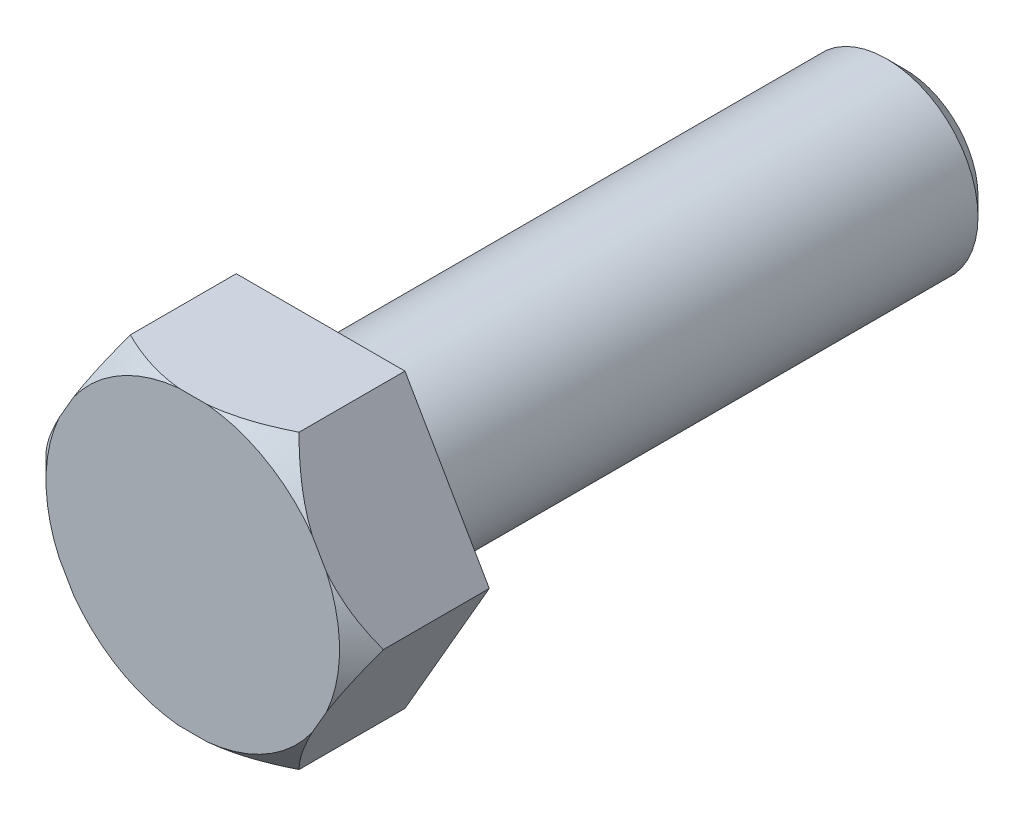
ISO-10303-21;
HEADER;
FILE_DESCRIPTION(('STEP AP214'),'2;1');
FILE_NAME('part.step','',(''),(''),'','','');
FILE_SCHEMA(('AUTOMOTIVE_DESIGN { 1 0 10303 214 1 1 1 1 }'));
ENDSEC;
DATA;
#1=APPLICATION_CONTEXT('core data for automotive mechanical design processes');
#2=APPLICATION_PROTOCOL_DEFINITION('international standard','automotive_design',2000,#1);
#3=PRODUCT_CONTEXT('',#1,'mechanical');
#4=PRODUCT('Part','Part','',(#3));
#5=PRODUCT_RELATED_PRODUCT_CATEGORY('part','',(#4));
#6=PRODUCT_DEFINITION_FORMATION('','',#4);
#7=PRODUCT_DEFINITION_CONTEXT('part definition',#1,'design');
#8=PRODUCT_DEFINITION('design','',#6,#7);
#9=PRODUCT_DEFINITION_SHAPE('','',#8);
#10=(LENGTH_UNIT() NAMED_UNIT(*) SI_UNIT(.MILLI.,.METRE.));
#11=(NAMED_UNIT(*) PLANE_ANGLE_UNIT() SI_UNIT($,.RADIAN.));
#12=(NAMED_UNIT(*) SI_UNIT($,.STERADIAN.) SOLID_ANGLE_UNIT());
#13=UNCERTAINTY_MEASURE_WITH_UNIT(LENGTH_MEASURE(1.E-05),#10,'distance_accuracy_value','');
#14=(GEOMETRIC_REPRESENTATION_CONTEXT(3) GLOBAL_UNCERTAINTY_ASSIGNED_CONTEXT((#13)) GLOBAL_UNIT_ASSIGNED_CONTEXT((#10,
#11,#12)) REPRESENTATION_CONTEXT('',''));
#15=CARTESIAN_POINT('',(0.,0.,0.));
#16=DIRECTION('',(0.,0.,1.));
#17=DIRECTION('',(1.,0.,0.));
#18=AXIS2_PLACEMENT_3D('',#15,#16,#17);
#19=CARTESIAN_POINT('',(0.,-2.5,0.));
#20=DIRECTION('',(0.,0.,1.));
#21=DIRECTION('',(1.,0.,0.));
#22=AXIS2_PLACEMENT_3D('',#19,#20,#21);
#23=PLANE('',#22);
#24=CARTESIAN_POINT('',(0.,0.,0.));
#25=DIRECTION('',(0.,0.,1.));
#26=DIRECTION('',(1.,0.,0.));
#27=AXIS2_PLACEMENT_3D('',#24,#25,#26);
#28=CIRCLE('',#27,2.5);
#29=CARTESIAN_POINT('',(2.5,0.,0.));
#30=VERTEX_POINT('',#29);
#31=EDGE_CURVE('E11',#30,#30,#28,.T.);
#32=ORIENTED_EDGE('',*,*,#31,.T.);
#33=EDGE_LOOP('',(#32));
#34=FACE_BOUND('',#33,.T.);
#35=ADVANCED_FACE('F39',(#34),#23,.T.);
#36=CARTESIAN_POINT('',(0.,0.,0.));
#37=DIRECTION('',(0.,0.,1.));
#38=DIRECTION('',(1.,0.,0.));
#39=AXIS2_PLACEMENT_3D('',#36,#37,#38);
#40=CYLINDRICAL_SURFACE('',#39,2.5);
#41=CARTESIAN_POINT('',(0.,0.,-15.5));
#42=DIRECTION('',(0.,0.,1.));
#43=DIRECTION('',(1.,0.,0.));
#44=AXIS2_PLACEMENT_3D('',#41,#42,#43);
#45=CIRCLE('',#44,2.5);
#46=CARTESIAN_POINT('',(2.5,0.,-15.5));
#47=VERTEX_POINT('',#46);
#48=EDGE_CURVE('E45',#47,#47,#45,.T.);
#49=ORIENTED_EDGE('',*,*,#48,.T.);
#50=EDGE_LOOP('',(#49));
#51=FACE_BOUND('',#50,.T.);
#52=ORIENTED_EDGE('',*,*,#31,.F.);
#53=EDGE_LOOP('',(#52));
#54=FACE_BOUND('',#53,.T.);
#55=ADVANCED_FACE('F65',(#51,#54),#40,.T.);
#56=CARTESIAN_POINT('',(0.,0.,-15.5));
#57=DIRECTION('',(0.,0.,1.));
#58=DIRECTION('',(1.,0.,0.));
#59=AXIS2_PLACEMENT_3D('',#56,#57,#58);
#60=CONICAL_SURFACE('',#59,2.5,0.785398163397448);
#61=CARTESIAN_POINT('',(0.,0.,-16.));
#62=DIRECTION('',(0.,0.,1.));
#63=DIRECTION('',(1.,0.,0.));
#64=AXIS2_PLACEMENT_3D('',#61,#62,#63);
#65=CIRCLE('',#64,2.);
#66=CARTESIAN_POINT('',(2.,0.,-16.));
#67=VERTEX_POINT('',#66);
#68=EDGE_CURVE('E49',#67,#67,#65,.T.);
#69=ORIENTED_EDGE('',*,*,#68,.T.);
#70=EDGE_LOOP('',(#69));
#71=FACE_BOUND('',#70,.T.);
#72=ORIENTED_EDGE('',*,*,#48,.F.);
#73=EDGE_LOOP('',(#72));
#74=FACE_BOUND('',#73,.T.);
#75=ADVANCED_FACE('F56',(#71,#74),#60,.T.);
#76=CARTESIAN_POINT('',(0.,-2.,-16.));
#77=DIRECTION('',(0.,0.,-1.));
#78=DIRECTION('',(-1.,0.,0.));
#79=AXIS2_PLACEMENT_3D('',#76,#77,#78);
#80=PLANE('',#79);
#81=ORIENTED_EDGE('',*,*,#68,.F.);
#82=EDGE_LOOP('',(#81));
#83=FACE_BOUND('',#82,.T.);
#84=ADVANCED_FACE('F59',(#83),#80,.T.);
#85=CLOSED_SHELL('',(#35,#55,#75,#84));
#86=MANIFOLD_SOLID_BREP('B2',#85);
#87=CARTESIAN_POINT('',(2.3094010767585,-4.,3.5));
#88=DIRECTION('',(-0.866025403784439,0.5,0.));
#89=DIRECTION('',(-0.5,-0.866025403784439,0.));
#90=AXIS2_PLACEMENT_3D('',#87,#88,#89);
#91=PLANE('',#90);
#92=DIRECTION('',(0.,0.,-1.));
#93=VECTOR('',#92,1.);
#94=CARTESIAN_POINT('',(4.61880215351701,0.,3.5));
#95=LINE('',#94,#93);
#96=CARTESIAN_POINT('',(4.61880215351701,0.,2.9));
#97=VERTEX_POINT('',#96);
#98=CARTESIAN_POINT('',(4.61880215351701,0.,0.));
#99=VERTEX_POINT('',#98);
#100=EDGE_CURVE('E242',#97,#99,#95,.T.);
#101=ORIENTED_EDGE('',*,*,#100,.F.);
#102=CARTESIAN_POINT('',(6.23236114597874,2.79476615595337,0.688498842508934));
#103=CARTESIAN_POINT('',(6.17765325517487,2.70000930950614,0.777178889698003));
#104=CARTESIAN_POINT('',(6.12272857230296,2.60487696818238,0.865328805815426));
#105=CARTESIAN_POINT('',(6.01237057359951,2.41373130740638,1.04036549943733));
#106=CARTESIAN_POINT('',(5.95693721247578,2.31771790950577,1.12725216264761));
#107=CARTESIAN_POINT('',(5.84536515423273,2.12446943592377,1.29974670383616));
#108=CARTESIAN_POINT('',(5.78922510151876,2.02723201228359,1.3853510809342));
#109=CARTESIAN_POINT('',(5.67628342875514,1.83161129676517,1.55479243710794));
#110=CARTESIAN_POINT('',(5.61948182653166,1.73322803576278,1.63862946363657));
#111=CARTESIAN_POINT('',(5.50353794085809,1.53240733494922,1.80647993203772));
#112=CARTESIAN_POINT('',(5.44437430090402,1.42993290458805,1.89043450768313));
#113=CARTESIAN_POINT('',(5.32511378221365,1.22336762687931,2.05564703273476));
#114=CARTESIAN_POINT('',(5.26501693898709,1.11927684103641,2.13690508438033));
#115=CARTESIAN_POINT('',(5.14378925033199,0.909304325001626,2.296059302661));
#116=CARTESIAN_POINT('',(5.08265932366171,0.803424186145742,2.37395825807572));
#117=CARTESIAN_POINT('',(4.95915384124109,0.589506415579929,2.52568435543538));
#118=CARTESIAN_POINT('',(4.89677844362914,0.481469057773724,2.59951200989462));
#119=CARTESIAN_POINT('',(4.76893339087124,0.260034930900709,2.74398038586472));
#120=CARTESIAN_POINT('',(4.7034254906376,0.146571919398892,2.81448663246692));
#121=CARTESIAN_POINT('',(4.570685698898,-0.0833401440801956,2.94879092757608));
#122=CARTESIAN_POINT('',(4.50345356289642,-0.199789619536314,3.01258801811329));
#123=CARTESIAN_POINT('',(4.3674844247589,-0.43529507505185,3.13137401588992));
#124=CARTESIAN_POINT('',(4.29875750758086,-0.554333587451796,3.1864086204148));
#125=CARTESIAN_POINT('',(4.15941510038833,-0.795681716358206,3.28596217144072));
#126=CARTESIAN_POINT('',(4.0888001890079,-0.91799033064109,3.3304842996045));
#127=CARTESIAN_POINT('',(3.95986044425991,-1.14132051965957,3.39923411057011));
#128=CARTESIAN_POINT('',(3.90183954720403,-1.24181566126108,3.42572915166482));
#129=CARTESIAN_POINT('',(3.78491444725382,-1.44433587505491,3.46929589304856));
#130=CARTESIAN_POINT('',(3.72601037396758,-1.54636072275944,3.48636896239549));
#131=CARTESIAN_POINT('',(3.60778145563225,-1.75113921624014,3.5102149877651));
#132=CARTESIAN_POINT('',(3.54845754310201,-1.85389124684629,3.51700617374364));
#133=CARTESIAN_POINT('',(3.42974154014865,-2.059513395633,3.51997326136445));
#134=CARTESIAN_POINT('',(3.3703494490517,-2.16238351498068,3.51614905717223));
#135=CARTESIAN_POINT('',(3.2521230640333,-2.36715762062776,3.49812146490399));
#136=CARTESIAN_POINT('',(3.19328771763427,-2.46906342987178,3.48394524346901));
#137=CARTESIAN_POINT('',(3.07639557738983,-2.67152655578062,3.44597172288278));
#138=CARTESIAN_POINT('',(3.01833897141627,-2.77208354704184,3.42217214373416));
#139=CARTESIAN_POINT('',(2.90311219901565,-2.97166217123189,3.36593528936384));
#140=CARTESIAN_POINT('',(2.84594516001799,-3.0706783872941,3.33347269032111));
#141=CARTESIAN_POINT('',(2.73281133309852,-3.26663192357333,3.26114482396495));
#142=CARTESIAN_POINT('',(2.67684448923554,-3.36356934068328,3.22127990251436));
#143=CARTESIAN_POINT('',(2.54652000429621,-3.58929797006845,3.12008468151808));
#144=CARTESIAN_POINT('',(2.47266940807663,-3.71721095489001,3.05615257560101));
#145=CARTESIAN_POINT('',(2.32705313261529,-3.969425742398,2.91934821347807));
#146=CARTESIAN_POINT('',(2.25528857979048,-4.09372559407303,2.84647123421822));
#147=CARTESIAN_POINT('',(2.11349363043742,-4.33932165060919,2.69363109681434));
#148=CARTESIAN_POINT('',(2.04346714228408,-4.46061108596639,2.61365354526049));
#149=CARTESIAN_POINT('',(1.90505877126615,-4.7003414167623,2.4482849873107));
#150=CARTESIAN_POINT('',(1.83667660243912,-4.81878280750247,2.36289493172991));
#151=CARTESIAN_POINT('',(1.70098891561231,-5.05380077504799,2.18743214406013));
#152=CARTESIAN_POINT('',(1.63368983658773,-5.17036619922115,2.09733958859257));
#153=CARTESIAN_POINT('',(1.50027452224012,-5.401448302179,1.91370612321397));
#154=CARTESIAN_POINT('',(1.43415838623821,-5.51596480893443,1.82016492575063));
#155=CARTESIAN_POINT('',(1.30300471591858,-5.74312962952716,1.63040915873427));
#156=CARTESIAN_POINT('',(1.23796608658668,-5.85577983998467,1.53419760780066));
#157=CARTESIAN_POINT('',(1.10874167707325,-6.07960308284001,1.33950918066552));
#158=CARTESIAN_POINT('',(1.0445559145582,-6.19077608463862,1.24103225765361));
#159=CARTESIAN_POINT('',(0.932766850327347,-6.38440042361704,1.06690301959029));
#160=CARTESIAN_POINT('',(0.885004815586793,-6.46712669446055,0.991657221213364));
#161=CARTESIAN_POINT('',(0.790056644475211,-6.63158175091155,0.840569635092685));
#162=CARTESIAN_POINT('',(0.742868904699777,-6.71331331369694,0.764731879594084));
#163=CARTESIAN_POINT('',(0.695842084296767,-6.79476615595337,0.688498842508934));
#164=B_SPLINE_CURVE_WITH_KNOTS('',3,(#102,#103,#104,#105,#106,#107,#108,#109,#110,#111,#112,
#113,#114,#115,#116,#117,#118,#119,#120,#121,#122,#123,#124,#125,#126,#127,#128,#129,#130,#131,
#132,#133,#134,#135,#136,#137,#138,#139,#140,#141,#142,#143,#144,#145,#146,#147,#148,#149,#150,
#151,#152,#153,#154,#155,#156,#157,#158,#159,#160,#161,#162,#163),.UNSPECIFIED.,.F.,.F.,(4,2,2,
2,2,2,2,2,2,2,2,2,2,2,2,2,2,2,2,2,2,2,2,2,2,2,2,2,2,2,4),(0.,0.422523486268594,
0.845084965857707,1.26864344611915,1.69219053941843,2.12741530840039,2.56262355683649,
2.99746324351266,3.43224806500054,3.87844266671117,4.32470089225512,4.76854968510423,
5.21226397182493,5.56900884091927,5.92570185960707,6.28176171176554,6.63782511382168,
6.99295744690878,7.34817396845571,7.70444045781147,8.06069030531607,8.54311709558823,
9.02579972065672,9.50948415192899,9.99308384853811,10.4789192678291,10.964795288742,
11.450142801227,11.9355003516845,12.3002974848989,12.6635031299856),.UNSPECIFIED.);
#165=CARTESIAN_POINT('',(3.65824766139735,-1.66372918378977,3.5));
#166=VERTEX_POINT('',#165);
#167=EDGE_CURVE('E220',#97,#166,#164,.T.);
#168=ORIENTED_EDGE('',*,*,#167,.T.);
#169=DIRECTION('',(0.5,0.866025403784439,0.));
#170=VECTOR('',#169,1.);
#171=CARTESIAN_POINT('',(2.3094010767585,-4.,3.5));
#172=LINE('',#171,#170);
#173=CARTESIAN_POINT('',(3.26995556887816,-2.33627081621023,3.5));
#174=VERTEX_POINT('',#173);
#175=EDGE_CURVE('E234',#174,#166,#172,.T.);
#176=ORIENTED_EDGE('',*,*,#175,.F.);
#177=CARTESIAN_POINT('',(2.3094010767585,-4.,2.9));
#178=VERTEX_POINT('',#177);
#179=EDGE_CURVE('E307',#174,#178,#164,.T.);
#180=ORIENTED_EDGE('',*,*,#179,.T.);
#181=DIRECTION('',(0.,0.,-1.));
#182=VECTOR('',#181,1.);
#183=CARTESIAN_POINT('',(2.3094010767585,-4.,3.5));
#184=LINE('',#183,#182);
#185=CARTESIAN_POINT('',(2.3094010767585,-4.,0.));
#186=VERTEX_POINT('',#185);
#187=EDGE_CURVE('E215',#178,#186,#184,.T.);
#188=ORIENTED_EDGE('',*,*,#187,.T.);
#189=DIRECTION('',(0.5,0.866025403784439,0.));
#190=VECTOR('',#189,1.);
#191=CARTESIAN_POINT('',(2.3094010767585,-4.,0.));
#192=LINE('',#191,#190);
#193=EDGE_CURVE('E216',#186,#99,#192,.T.);
#194=ORIENTED_EDGE('',*,*,#193,.T.);
#195=EDGE_LOOP('',(#101,#168,#176,#180,#188,#194));
#196=FACE_BOUND('',#195,.T.);
#197=ADVANCED_FACE('F95',(#196),#91,.F.);
#198=CARTESIAN_POINT('',(4.61880215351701,0.,3.5));
#199=DIRECTION('',(-0.866025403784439,-0.5,0.));
#200=DIRECTION('',(0.5,-0.866025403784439,0.));
#201=AXIS2_PLACEMENT_3D('',#198,#199,#200);
#202=PLANE('',#201);
#203=DIRECTION('',(0.,0.,-1.));
#204=VECTOR('',#203,1.);
#205=CARTESIAN_POINT('',(2.3094010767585,4.,3.5));
#206=LINE('',#205,#204);
#207=CARTESIAN_POINT('',(2.3094010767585,4.,2.9));
#208=VERTEX_POINT('',#207);
#209=CARTESIAN_POINT('',(2.3094010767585,4.,0.));
#210=VERTEX_POINT('',#209);
#211=EDGE_CURVE('E241',#208,#210,#206,.T.);
#212=ORIENTED_EDGE('',*,*,#211,.F.);
#213=CARTESIAN_POINT('',(0.695842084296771,6.79476615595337,0.688498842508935));
#214=CARTESIAN_POINT('',(0.75054997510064,6.70000930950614,0.777178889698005));
#215=CARTESIAN_POINT('',(0.805474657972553,6.60487696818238,0.865328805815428));
#216=CARTESIAN_POINT('',(0.915832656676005,6.41373130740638,1.04036549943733));
#217=CARTESIAN_POINT('',(0.971266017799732,6.31771790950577,1.12725216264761));
#218=CARTESIAN_POINT('',(1.08283807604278,6.12446943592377,1.29974670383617));
#219=CARTESIAN_POINT('',(1.13897812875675,6.02723201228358,1.3853510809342));
#220=CARTESIAN_POINT('',(1.25191980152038,5.83161129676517,1.55479243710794));
#221=CARTESIAN_POINT('',(1.30872140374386,5.73322803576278,1.63862946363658));
#222=CARTESIAN_POINT('',(1.42466528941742,5.53240733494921,1.80647993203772));
#223=CARTESIAN_POINT('',(1.48382892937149,5.42993290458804,1.89043450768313));
#224=CARTESIAN_POINT('',(1.60308944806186,5.22336762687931,2.05564703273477));
#225=CARTESIAN_POINT('',(1.66318629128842,5.11927684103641,2.13690508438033));
#226=CARTESIAN_POINT('',(1.78441397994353,4.90930432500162,2.296059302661));
#227=CARTESIAN_POINT('',(1.84554390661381,4.80342418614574,2.37395825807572));
#228=CARTESIAN_POINT('',(1.96904938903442,4.58950641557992,2.52568435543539));
#229=CARTESIAN_POINT('',(2.03142478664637,4.48146905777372,2.59951200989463));
#230=CARTESIAN_POINT('',(2.15926983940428,4.2600349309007,2.74398038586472));
#231=CARTESIAN_POINT('',(2.22477773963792,4.14657191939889,2.81448663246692));
#232=CARTESIAN_POINT('',(2.35751753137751,3.9166598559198,2.94879092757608));
#233=CARTESIAN_POINT('',(2.42474966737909,3.80021038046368,3.01258801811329));
#234=CARTESIAN_POINT('',(2.56071880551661,3.56470492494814,3.13137401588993));
#235=CARTESIAN_POINT('',(2.62944572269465,3.4456664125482,3.1864086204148));
#236=CARTESIAN_POINT('',(2.76878812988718,3.20431828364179,3.28596217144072));
#237=CARTESIAN_POINT('',(2.83940304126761,3.0820096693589,3.3304842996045));
#238=CARTESIAN_POINT('',(2.9683427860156,2.85867948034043,3.39923411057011));
#239=CARTESIAN_POINT('',(3.02636368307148,2.75818433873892,3.42572915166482));
#240=CARTESIAN_POINT('',(3.14328878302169,2.55566412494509,3.46929589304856));
#241=CARTESIAN_POINT('',(3.20219285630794,2.45363927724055,3.48636896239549));
#242=CARTESIAN_POINT('',(3.32042177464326,2.24886078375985,3.5102149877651));
#243=CARTESIAN_POINT('',(3.3797456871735,2.1461087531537,3.51700617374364));
#244=CARTESIAN_POINT('',(3.49846169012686,1.94048660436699,3.51997326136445));
#245=CARTESIAN_POINT('',(3.55785378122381,1.83761648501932,3.51614905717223));
#246=CARTESIAN_POINT('',(3.67608016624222,1.63284237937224,3.49812146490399));
#247=CARTESIAN_POINT('',(3.73491551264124,1.53093657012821,3.48394524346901));
#248=CARTESIAN_POINT('',(3.85180765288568,1.32847344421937,3.44597172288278));
#249=CARTESIAN_POINT('',(3.90986425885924,1.22791645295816,3.42217214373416));
#250=CARTESIAN_POINT('',(4.02509103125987,1.02833782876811,3.36593528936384));
#251=CARTESIAN_POINT('',(4.08225807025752,0.929321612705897,3.33347269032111));
#252=CARTESIAN_POINT('',(4.19539189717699,0.733368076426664,3.26114482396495));
#253=CARTESIAN_POINT('',(4.25135874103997,0.636430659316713,3.22127990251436));
#254=CARTESIAN_POINT('',(4.3816832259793,0.410702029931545,3.12008468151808));
#255=CARTESIAN_POINT('',(4.45553382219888,0.282789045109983,3.05615257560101));
#256=CARTESIAN_POINT('',(4.60115009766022,0.0305742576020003,2.91934821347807));
#257=CARTESIAN_POINT('',(4.67291465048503,-0.0937255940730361,2.84647123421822));
#258=CARTESIAN_POINT('',(4.81470959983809,-0.33932165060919,2.69363109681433));
#259=CARTESIAN_POINT('',(4.88473608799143,-0.460611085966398,2.61365354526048));
#260=CARTESIAN_POINT('',(5.02314445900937,-0.700341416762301,2.4482849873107));
#261=CARTESIAN_POINT('',(5.0915266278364,-0.818782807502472,2.36289493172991));
#262=CARTESIAN_POINT('',(5.2272143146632,-1.05380077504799,2.18743214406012));
#263=CARTESIAN_POINT('',(5.29451339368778,-1.17036619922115,2.09733958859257));
#264=CARTESIAN_POINT('',(5.4279287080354,-1.401448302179,1.91370612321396));
#265=CARTESIAN_POINT('',(5.4940448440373,-1.51596480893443,1.82016492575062));
#266=CARTESIAN_POINT('',(5.62519851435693,-1.74312962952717,1.63040915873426));
#267=CARTESIAN_POINT('',(5.69023714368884,-1.85577983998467,1.53419760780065));
#268=CARTESIAN_POINT('',(5.81946155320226,-2.07960308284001,1.33950918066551));
#269=CARTESIAN_POINT('',(5.88364731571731,-2.19077608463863,1.24103225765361));
#270=CARTESIAN_POINT('',(5.99543637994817,-2.38440042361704,1.06690301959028));
#271=CARTESIAN_POINT('',(6.04319841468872,-2.46712669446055,0.991657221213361));
#272=CARTESIAN_POINT('',(6.1381465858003,-2.63158175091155,0.840569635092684));
#273=CARTESIAN_POINT('',(6.18533432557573,-2.71331331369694,0.764731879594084));
#274=CARTESIAN_POINT('',(6.23236114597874,-2.79476615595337,0.688498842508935));
#275=B_SPLINE_CURVE_WITH_KNOTS('',3,(#213,#214,#215,#216,#217,#218,#219,#220,#221,#222,#223,
#224,#225,#226,#227,#228,#229,#230,#231,#232,#233,#234,#235,#236,#237,#238,#239,#240,#241,#242,
#243,#244,#245,#246,#247,#248,#249,#250,#251,#252,#253,#254,#255,#256,#257,#258,#259,#260,#261,
#262,#263,#264,#265,#266,#267,#268,#269,#270,#271,#272,#273,#274),.UNSPECIFIED.,.F.,.F.,(4,2,2,
2,2,2,2,2,2,2,2,2,2,2,2,2,2,2,2,2,2,2,2,2,2,2,2,2,2,2,4),(0.,0.422523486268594,
0.845084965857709,1.26864344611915,1.69219053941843,2.12741530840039,2.5626235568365,
2.99746324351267,3.43224806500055,3.87844266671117,4.32470089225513,4.76854968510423,
5.21226397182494,5.56900884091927,5.92570185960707,6.28176171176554,6.63782511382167,
6.99295744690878,7.34817396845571,7.70444045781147,8.06069030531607,8.54311709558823,
9.02579972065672,9.50948415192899,9.99308384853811,10.4789192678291,10.9647952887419,
11.450142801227,11.9355003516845,12.3002974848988,12.6635031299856),.UNSPECIFIED.);
#276=CARTESIAN_POINT('',(3.26995556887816,2.33627081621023,3.5));
#277=VERTEX_POINT('',#276);
#278=EDGE_CURVE('E270',#208,#277,#275,.T.);
#279=ORIENTED_EDGE('',*,*,#278,.T.);
#280=DIRECTION('',(-0.5,0.866025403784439,0.));
#281=VECTOR('',#280,1.);
#282=CARTESIAN_POINT('',(4.61880215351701,0.,3.5));
#283=LINE('',#282,#281);
#284=CARTESIAN_POINT('',(3.65824766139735,1.66372918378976,3.5));
#285=VERTEX_POINT('',#284);
#286=EDGE_CURVE('E209',#285,#277,#283,.T.);
#287=ORIENTED_EDGE('',*,*,#286,.F.);
#288=EDGE_CURVE('E275',#285,#97,#275,.T.);
#289=ORIENTED_EDGE('',*,*,#288,.T.);
#290=ORIENTED_EDGE('',*,*,#100,.T.);
#291=DIRECTION('',(-0.5,0.866025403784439,0.));
#292=VECTOR('',#291,1.);
#293=CARTESIAN_POINT('',(4.61880215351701,0.,0.));
#294=LINE('',#293,#292);
#295=EDGE_CURVE('E219',#99,#210,#294,.T.);
#296=ORIENTED_EDGE('',*,*,#295,.T.);
#297=EDGE_LOOP('',(#212,#279,#287,#289,#290,#296));
#298=FACE_BOUND('',#297,.T.);
#299=ADVANCED_FACE('F280',(#298),#202,.F.);
#300=CARTESIAN_POINT('',(2.3094010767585,4.,3.5));
#301=DIRECTION('',(0.,-1.,0.));
#302=DIRECTION('',(1.,0.,0.));
#303=AXIS2_PLACEMENT_3D('',#300,#301,#302);
#304=PLANE('',#303);
#305=DIRECTION('',(0.,0.,-1.));
#306=VECTOR('',#305,1.);
#307=CARTESIAN_POINT('',(-2.3094010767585,4.,3.5));
#308=LINE('',#307,#306);
#309=CARTESIAN_POINT('',(-2.3094010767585,4.,2.9));
#310=VERTEX_POINT('',#309);
#311=CARTESIAN_POINT('',(-2.3094010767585,4.,0.));
#312=VERTEX_POINT('',#311);
#313=EDGE_CURVE('E239',#310,#312,#308,.T.);
#314=ORIENTED_EDGE('',*,*,#313,.F.);
#315=CARTESIAN_POINT('',(-5.10416723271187,4.,1.03401047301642));
#316=CARTESIAN_POINT('',(-4.98985882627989,4.,1.12396648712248));
#317=CARTESIAN_POINT('',(-4.87500222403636,4.,1.21323480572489));
#318=CARTESIAN_POINT('',(-4.64398100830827,4.,1.39010065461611));
#319=CARTESIAN_POINT('',(-4.52781618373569,4.,1.47769790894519));
#320=CARTESIAN_POINT('',(-4.29341594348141,4.,1.6513323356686));
#321=CARTESIAN_POINT('',(-4.17517305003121,4.,1.7373594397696));
#322=CARTESIAN_POINT('',(-3.93695487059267,4.,1.90697407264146));
#323=CARTESIAN_POINT('',(-3.81697966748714,4.,1.99056171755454));
#324=CARTESIAN_POINT('',(-3.56903053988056,4.,2.15883212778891));
#325=CARTESIAN_POINT('',(-3.44095437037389,4.,2.24336480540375));
#326=CARTESIAN_POINT('',(-3.18221357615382,4.,2.40836670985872));
#327=CARTESIAN_POINT('',(-3.05154916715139,4.,2.48883627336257));
#328=CARTESIAN_POINT('',(-2.78744760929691,4.,2.6445324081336));
#329=CARTESIAN_POINT('',(-2.65401614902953,4.,2.71976857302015));
#330=CARTESIAN_POINT('',(-2.38373289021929,4.,2.86379345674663));
#331=CARTESIAN_POINT('',(-2.24688202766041,4.,2.93258391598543));
#332=CARTESIAN_POINT('',(-1.98367043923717,4.,3.05530153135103));
#333=CARTESIAN_POINT('',(-1.85768607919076,4.,3.11002999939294));
#334=CARTESIAN_POINT('',(-1.60243753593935,4.,3.21135635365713));
#335=CARTESIAN_POINT('',(-1.47317303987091,4.,3.25795346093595));
#336=CARTESIAN_POINT('',(-1.21292441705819,4.,3.34074586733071));
#337=CARTESIAN_POINT('',(-1.08197637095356,4.,3.37705304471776));
#338=CARTESIAN_POINT('',(-0.817433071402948,4.,3.43815768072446));
#339=CARTESIAN_POINT('',(-0.683838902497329,4.,3.46295975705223));
#340=CARTESIAN_POINT('',(-0.412316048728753,4.,3.49989685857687));
#341=CARTESIAN_POINT('',(-0.274353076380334,4.,3.51178529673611));
#342=CARTESIAN_POINT('',(0.00205892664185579,4.,3.52118634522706));
#343=CARTESIAN_POINT('',(0.1405079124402,4.,3.51870024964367));
#344=CARTESIAN_POINT('',(0.41681462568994,4.,3.49951454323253));
#345=CARTESIAN_POINT('',(0.554669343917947,4.,3.48277242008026));
#346=CARTESIAN_POINT('',(0.828137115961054,4.,3.43620184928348));
#347=CARTESIAN_POINT('',(0.963749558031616,4.,3.40636988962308));
#348=CARTESIAN_POINT('',(1.27307598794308,4.,3.32450160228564));
#349=CARTESIAN_POINT('',(1.44572159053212,4.,3.26846152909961));
#350=CARTESIAN_POINT('',(1.78533180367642,4.,3.14129797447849));
#351=CARTESIAN_POINT('',(1.95229295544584,4.,3.07016549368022));
#352=CARTESIAN_POINT('',(2.28202183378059,4.,2.91595160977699));
#353=CARTESIAN_POINT('',(2.44474983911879,4.,2.83278642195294));
#354=CARTESIAN_POINT('',(2.76538092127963,4.,2.65780460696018));
#355=CARTESIAN_POINT('',(2.92328510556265,4.,2.56598998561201));
#356=CARTESIAN_POINT('',(3.25793446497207,4.,2.36185945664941));
#357=CARTESIAN_POINT('',(3.43404610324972,4.,2.24851177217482));
#358=CARTESIAN_POINT('',(3.78201930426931,4.,2.01543949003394));
#359=CARTESIAN_POINT('',(3.95387990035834,4.,1.89571346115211));
#360=CARTESIAN_POINT('',(4.29033684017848,4.,1.65419733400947));
#361=CARTESIAN_POINT('',(4.45500968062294,4.,1.53251336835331));
#362=CARTESIAN_POINT('',(4.69993893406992,4.,1.34736923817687));
#363=CARTESIAN_POINT('',(4.78120758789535,4.,1.28524011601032));
#364=CARTESIAN_POINT('',(4.94313113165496,4.,1.16019346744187));
#365=CARTESIAN_POINT('',(5.02378604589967,4.,1.09727597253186));
#366=CARTESIAN_POINT('',(5.10416723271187,4.,1.03401047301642));
#367=B_SPLINE_CURVE_WITH_KNOTS('',3,(#315,#316,#317,#318,#319,#320,#321,#322,#323,#324,#325,
#326,#327,#328,#329,#330,#331,#332,#333,#334,#335,#336,#337,#338,#339,#340,#341,#342,#343,#344,
#345,#346,#347,#348,#349,#350,#351,#352,#353,#354,#355,#356,#357,#358,#359,#360,#361,#362,#363,
#364,#365,#366),.UNSPECIFIED.,.F.,.F.,(4,2,2,2,2,2,2,2,2,2,2,2,2,2,2,2,2,2,2,2,2,2,2,2,2,4),(0.,
0.436384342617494,0.872840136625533,1.31149215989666,1.75012326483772,2.2104351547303,
2.67070884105,3.13011523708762,3.58939722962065,4.00124375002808,4.4131297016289,
4.82034865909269,5.22740403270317,5.64210248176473,6.05676359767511,6.47266560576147,
6.88867926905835,7.43226364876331,7.97617307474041,8.52407040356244,9.07184098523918,
9.6999549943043,10.3282105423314,10.9424080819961,11.2492945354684,11.5561687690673),.UNSPECIFIED.);
#368=CARTESIAN_POINT('',(-0.388292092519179,4.,3.5));
#369=VERTEX_POINT('',#368);
#370=EDGE_CURVE('E257',#310,#369,#367,.T.);
#371=ORIENTED_EDGE('',*,*,#370,.T.);
#372=DIRECTION('',(-1.,0.,0.));
#373=VECTOR('',#372,1.);
#374=CARTESIAN_POINT('',(2.3094010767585,4.,3.5));
#375=LINE('',#374,#373);
#376=CARTESIAN_POINT('',(0.38829209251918,4.,3.5));
#377=VERTEX_POINT('',#376);
#378=EDGE_CURVE('E205',#377,#369,#375,.T.);
#379=ORIENTED_EDGE('',*,*,#378,.F.);
#380=EDGE_CURVE('E263',#377,#208,#367,.T.);
#381=ORIENTED_EDGE('',*,*,#380,.T.);
#382=ORIENTED_EDGE('',*,*,#211,.T.);
#383=DIRECTION('',(-1.,0.,0.));
#384=VECTOR('',#383,1.);
#385=CARTESIAN_POINT('',(2.3094010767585,4.,0.));
#386=LINE('',#385,#384);
#387=EDGE_CURVE('E223',#210,#312,#386,.T.);
#388=ORIENTED_EDGE('',*,*,#387,.T.);
#389=EDGE_LOOP('',(#314,#371,#379,#381,#382,#388));
#390=FACE_BOUND('',#389,.T.);
#391=ADVANCED_FACE('F261',(#390),#304,.F.);
#392=CARTESIAN_POINT('',(-2.3094010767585,4.,3.5));
#393=DIRECTION('',(0.866025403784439,-0.5,0.));
#394=DIRECTION('',(0.5,0.866025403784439,0.));
#395=AXIS2_PLACEMENT_3D('',#392,#393,#394);
#396=PLANE('',#395);
#397=DIRECTION('',(0.,0.,-1.));
#398=VECTOR('',#397,1.);
#399=CARTESIAN_POINT('',(-4.61880215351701,0.,3.5));
#400=LINE('',#399,#398);
#401=CARTESIAN_POINT('',(-4.61880215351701,0.,2.9));
#402=VERTEX_POINT('',#401);
#403=CARTESIAN_POINT('',(-4.61880215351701,0.,0.));
#404=VERTEX_POINT('',#403);
#405=EDGE_CURVE('E197',#402,#404,#400,.T.);
#406=ORIENTED_EDGE('',*,*,#405,.F.);
#407=CARTESIAN_POINT('',(-6.23236114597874,-2.79476615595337,0.688498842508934));
#408=CARTESIAN_POINT('',(-6.17765325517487,-2.70000930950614,0.777178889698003));
#409=CARTESIAN_POINT('',(-6.12272857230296,-2.60487696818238,0.865328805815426));
#410=CARTESIAN_POINT('',(-6.01237057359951,-2.41373130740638,1.04036549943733));
#411=CARTESIAN_POINT('',(-5.95693721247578,-2.31771790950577,1.12725216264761));
#412=CARTESIAN_POINT('',(-5.84536515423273,-2.12446943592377,1.29974670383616));
#413=CARTESIAN_POINT('',(-5.78922510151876,-2.02723201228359,1.3853510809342));
#414=CARTESIAN_POINT('',(-5.67628342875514,-1.83161129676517,1.55479243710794));
#415=CARTESIAN_POINT('',(-5.61948182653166,-1.73322803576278,1.63862946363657));
#416=CARTESIAN_POINT('',(-5.50353794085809,-1.53240733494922,1.80647993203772));
#417=CARTESIAN_POINT('',(-5.44437430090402,-1.42993290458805,1.89043450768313));
#418=CARTESIAN_POINT('',(-5.32511378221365,-1.22336762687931,2.05564703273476));
#419=CARTESIAN_POINT('',(-5.26501693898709,-1.11927684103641,2.13690508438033));
#420=CARTESIAN_POINT('',(-5.14378925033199,-0.909304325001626,2.296059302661));
#421=CARTESIAN_POINT('',(-5.08265932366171,-0.803424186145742,2.37395825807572));
#422=CARTESIAN_POINT('',(-4.95915384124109,-0.589506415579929,2.52568435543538));
#423=CARTESIAN_POINT('',(-4.89677844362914,-0.481469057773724,2.59951200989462));
#424=CARTESIAN_POINT('',(-4.76893339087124,-0.260034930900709,2.74398038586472));
#425=CARTESIAN_POINT('',(-4.7034254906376,-0.146571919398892,2.81448663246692));
#426=CARTESIAN_POINT('',(-4.570685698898,0.0833401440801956,2.94879092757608));
#427=CARTESIAN_POINT('',(-4.50345356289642,0.199789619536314,3.01258801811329));
#428=CARTESIAN_POINT('',(-4.3674844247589,0.43529507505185,3.13137401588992));
#429=CARTESIAN_POINT('',(-4.29875750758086,0.554333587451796,3.1864086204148));
#430=CARTESIAN_POINT('',(-4.15941510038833,0.795681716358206,3.28596217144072));
#431=CARTESIAN_POINT('',(-4.0888001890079,0.91799033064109,3.3304842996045));
#432=CARTESIAN_POINT('',(-3.95986044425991,1.14132051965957,3.39923411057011));
#433=CARTESIAN_POINT('',(-3.90183954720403,1.24181566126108,3.42572915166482));
#434=CARTESIAN_POINT('',(-3.78491444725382,1.44433587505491,3.46929589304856));
#435=CARTESIAN_POINT('',(-3.72601037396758,1.54636072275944,3.48636896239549));
#436=CARTESIAN_POINT('',(-3.60778145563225,1.75113921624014,3.5102149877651));
#437=CARTESIAN_POINT('',(-3.54845754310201,1.85389124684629,3.51700617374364));
#438=CARTESIAN_POINT('',(-3.42974154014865,2.059513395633,3.51997326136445));
#439=CARTESIAN_POINT('',(-3.3703494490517,2.16238351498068,3.51614905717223));
#440=CARTESIAN_POINT('',(-3.2521230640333,2.36715762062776,3.49812146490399));
#441=CARTESIAN_POINT('',(-3.19328771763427,2.46906342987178,3.48394524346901));
#442=CARTESIAN_POINT('',(-3.07639557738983,2.67152655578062,3.44597172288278));
#443=CARTESIAN_POINT('',(-3.01833897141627,2.77208354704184,3.42217214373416));
#444=CARTESIAN_POINT('',(-2.90311219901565,2.97166217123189,3.36593528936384));
#445=CARTESIAN_POINT('',(-2.84594516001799,3.0706783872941,3.33347269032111));
#446=CARTESIAN_POINT('',(-2.73281133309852,3.26663192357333,3.26114482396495));
#447=CARTESIAN_POINT('',(-2.67684448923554,3.36356934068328,3.22127990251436));
#448=CARTESIAN_POINT('',(-2.54652000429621,3.58929797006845,3.12008468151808));
#449=CARTESIAN_POINT('',(-2.47266940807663,3.71721095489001,3.05615257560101));
#450=CARTESIAN_POINT('',(-2.32705313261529,3.969425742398,2.91934821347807));
#451=CARTESIAN_POINT('',(-2.25528857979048,4.09372559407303,2.84647123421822));
#452=CARTESIAN_POINT('',(-2.11349363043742,4.33932165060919,2.69363109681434));
#453=CARTESIAN_POINT('',(-2.04346714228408,4.46061108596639,2.61365354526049));
#454=CARTESIAN_POINT('',(-1.90505877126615,4.7003414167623,2.4482849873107));
#455=CARTESIAN_POINT('',(-1.83667660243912,4.81878280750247,2.36289493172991));
#456=CARTESIAN_POINT('',(-1.70098891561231,5.05380077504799,2.18743214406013));
#457=CARTESIAN_POINT('',(-1.63368983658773,5.17036619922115,2.09733958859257));
#458=CARTESIAN_POINT('',(-1.50027452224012,5.401448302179,1.91370612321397));
#459=CARTESIAN_POINT('',(-1.43415838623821,5.51596480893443,1.82016492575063));
#460=CARTESIAN_POINT('',(-1.30300471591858,5.74312962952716,1.63040915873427));
#461=CARTESIAN_POINT('',(-1.23796608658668,5.85577983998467,1.53419760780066));
#462=CARTESIAN_POINT('',(-1.10874167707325,6.07960308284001,1.33950918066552));
#463=CARTESIAN_POINT('',(-1.0445559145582,6.19077608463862,1.24103225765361));
#464=CARTESIAN_POINT('',(-0.932766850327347,6.38440042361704,1.06690301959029));
#465=CARTESIAN_POINT('',(-0.885004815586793,6.46712669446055,0.991657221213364));
#466=CARTESIAN_POINT('',(-0.790056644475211,6.63158175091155,0.840569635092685));
#467=CARTESIAN_POINT('',(-0.742868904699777,6.71331331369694,0.764731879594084));
#468=CARTESIAN_POINT('',(-0.695842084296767,6.79476615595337,0.688498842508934));
#469=B_SPLINE_CURVE_WITH_KNOTS('',3,(#407,#408,#409,#410,#411,#412,#413,#414,#415,#416,#417,
#418,#419,#420,#421,#422,#423,#424,#425,#426,#427,#428,#429,#430,#431,#432,#433,#434,#435,#436,
#437,#438,#439,#440,#441,#442,#443,#444,#445,#446,#447,#448,#449,#450,#451,#452,#453,#454,#455,
#456,#457,#458,#459,#460,#461,#462,#463,#464,#465,#466,#467,#468),.UNSPECIFIED.,.F.,.F.,(4,2,2,
2,2,2,2,2,2,2,2,2,2,2,2,2,2,2,2,2,2,2,2,2,2,2,2,2,2,2,4),(0.,0.422523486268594,
0.845084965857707,1.26864344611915,1.69219053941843,2.12741530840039,2.56262355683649,
2.99746324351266,3.43224806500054,3.87844266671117,4.32470089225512,4.76854968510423,
5.21226397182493,5.56900884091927,5.92570185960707,6.28176171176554,6.63782511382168,
6.99295744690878,7.34817396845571,7.70444045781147,8.06069030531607,8.54311709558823,
9.02579972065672,9.50948415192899,9.99308384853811,10.4789192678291,10.964795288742,
11.450142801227,11.9355003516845,12.3002974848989,12.6635031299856),.UNSPECIFIED.);
#470=CARTESIAN_POINT('',(-3.65824766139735,1.66372918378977,3.5));
#471=VERTEX_POINT('',#470);
#472=EDGE_CURVE('E184',#402,#471,#469,.T.);
#473=ORIENTED_EDGE('',*,*,#472,.T.);
#474=DIRECTION('',(-0.5,-0.866025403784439,0.));
#475=VECTOR('',#474,1.);
#476=CARTESIAN_POINT('',(-2.3094010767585,4.,3.5));
#477=LINE('',#476,#475);
#478=CARTESIAN_POINT('',(-3.26995556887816,2.33627081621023,3.5));
#479=VERTEX_POINT('',#478);
#480=EDGE_CURVE('E195',#479,#471,#477,.T.);
#481=ORIENTED_EDGE('',*,*,#480,.F.);
#482=EDGE_CURVE('E198',#479,#310,#469,.T.);
#483=ORIENTED_EDGE('',*,*,#482,.T.);
#484=ORIENTED_EDGE('',*,*,#313,.T.);
#485=DIRECTION('',(-0.5,-0.866025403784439,0.));
#486=VECTOR('',#485,1.);
#487=CARTESIAN_POINT('',(-2.3094010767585,4.,0.));
#488=LINE('',#487,#486);
#489=EDGE_CURVE('E226',#312,#404,#488,.T.);
#490=ORIENTED_EDGE('',*,*,#489,.T.);
#491=EDGE_LOOP('',(#406,#473,#481,#483,#484,#490));
#492=FACE_BOUND('',#491,.T.);
#493=ADVANCED_FACE('F193',(#492),#396,.F.);
#494=CARTESIAN_POINT('',(-4.61880215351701,0.,3.5));
#495=DIRECTION('',(0.866025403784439,0.5,0.));
#496=DIRECTION('',(-0.5,0.866025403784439,0.));
#497=AXIS2_PLACEMENT_3D('',#494,#495,#496);
#498=PLANE('',#497);
#499=DIRECTION('',(0.,0.,-1.));
#500=VECTOR('',#499,1.);
#501=CARTESIAN_POINT('',(-2.3094010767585,-4.,3.5));
#502=LINE('',#501,#500);
#503=CARTESIAN_POINT('',(-2.3094010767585,-4.,2.9));
#504=VERTEX_POINT('',#503);
#505=CARTESIAN_POINT('',(-2.3094010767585,-4.,0.));
#506=VERTEX_POINT('',#505);
#507=EDGE_CURVE('E236',#504,#506,#502,.T.);
#508=ORIENTED_EDGE('',*,*,#507,.F.);
#509=CARTESIAN_POINT('',(-0.695842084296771,-6.79476615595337,0.688498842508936));
#510=CARTESIAN_POINT('',(-0.750549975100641,-6.70000930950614,0.777178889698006));
#511=CARTESIAN_POINT('',(-0.805474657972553,-6.60487696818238,0.865328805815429));
#512=CARTESIAN_POINT('',(-0.915832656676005,-6.41373130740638,1.04036549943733));
#513=CARTESIAN_POINT('',(-0.971266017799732,-6.31771790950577,1.12725216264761));
#514=CARTESIAN_POINT('',(-1.08283807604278,-6.12446943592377,1.29974670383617));
#515=CARTESIAN_POINT('',(-1.13897812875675,-6.02723201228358,1.3853510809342));
#516=CARTESIAN_POINT('',(-1.25191980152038,-5.83161129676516,1.55479243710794));
#517=CARTESIAN_POINT('',(-1.30872140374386,-5.73322803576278,1.63862946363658));
#518=CARTESIAN_POINT('',(-1.42466528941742,-5.53240733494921,1.80647993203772));
#519=CARTESIAN_POINT('',(-1.4838289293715,-5.42993290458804,1.89043450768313));
#520=CARTESIAN_POINT('',(-1.60308944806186,-5.22336762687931,2.05564703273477));
#521=CARTESIAN_POINT('',(-1.66318629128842,-5.11927684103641,2.13690508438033));
#522=CARTESIAN_POINT('',(-1.78441397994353,-4.90930432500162,2.296059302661));
#523=CARTESIAN_POINT('',(-1.84554390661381,-4.80342418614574,2.37395825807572));
#524=CARTESIAN_POINT('',(-1.96904938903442,-4.58950641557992,2.52568435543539));
#525=CARTESIAN_POINT('',(-2.03142478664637,-4.48146905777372,2.59951200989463));
#526=CARTESIAN_POINT('',(-2.15926983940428,-4.2600349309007,2.74398038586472));
#527=CARTESIAN_POINT('',(-2.22477773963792,-4.14657191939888,2.81448663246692));
#528=CARTESIAN_POINT('',(-2.35751753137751,-3.9166598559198,2.94879092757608));
#529=CARTESIAN_POINT('',(-2.42474966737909,-3.80021038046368,3.01258801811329));
#530=CARTESIAN_POINT('',(-2.56071880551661,-3.56470492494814,3.13137401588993));
#531=CARTESIAN_POINT('',(-2.62944572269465,-3.4456664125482,3.1864086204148));
#532=CARTESIAN_POINT('',(-2.76878812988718,-3.20431828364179,3.28596217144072));
#533=CARTESIAN_POINT('',(-2.83940304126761,-3.0820096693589,3.3304842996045));
#534=CARTESIAN_POINT('',(-2.9683427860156,-2.85867948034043,3.39923411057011));
#535=CARTESIAN_POINT('',(-3.02636368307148,-2.75818433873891,3.42572915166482));
#536=CARTESIAN_POINT('',(-3.14328878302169,-2.55566412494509,3.46929589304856));
#537=CARTESIAN_POINT('',(-3.20219285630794,-2.45363927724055,3.48636896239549));
#538=CARTESIAN_POINT('',(-3.32042177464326,-2.24886078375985,3.5102149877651));
#539=CARTESIAN_POINT('',(-3.3797456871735,-2.1461087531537,3.51700617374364));
#540=CARTESIAN_POINT('',(-3.49846169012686,-1.94048660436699,3.51997326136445));
#541=CARTESIAN_POINT('',(-3.55785378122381,-1.83761648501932,3.51614905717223));
#542=CARTESIAN_POINT('',(-3.67608016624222,-1.63284237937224,3.49812146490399));
#543=CARTESIAN_POINT('',(-3.73491551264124,-1.53093657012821,3.483945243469));
#544=CARTESIAN_POINT('',(-3.85180765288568,-1.32847344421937,3.44597172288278));
#545=CARTESIAN_POINT('',(-3.90986425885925,-1.22791645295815,3.42217214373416));
#546=CARTESIAN_POINT('',(-4.02509103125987,-1.0283378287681,3.36593528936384));
#547=CARTESIAN_POINT('',(-4.08225807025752,-0.929321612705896,3.33347269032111));
#548=CARTESIAN_POINT('',(-4.19539189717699,-0.733368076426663,3.26114482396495));
#549=CARTESIAN_POINT('',(-4.25135874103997,-0.636430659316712,3.22127990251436));
#550=CARTESIAN_POINT('',(-4.3816832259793,-0.410702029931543,3.12008468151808));
#551=CARTESIAN_POINT('',(-4.45553382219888,-0.282789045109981,3.05615257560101));
#552=CARTESIAN_POINT('',(-4.60115009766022,-0.0305742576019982,2.91934821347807));
#553=CARTESIAN_POINT('',(-4.67291465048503,0.0937255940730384,2.84647123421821));
#554=CARTESIAN_POINT('',(-4.81470959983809,0.339321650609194,2.69363109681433));
#555=CARTESIAN_POINT('',(-4.88473608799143,0.460611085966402,2.61365354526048));
#556=CARTESIAN_POINT('',(-5.02314445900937,0.700341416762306,2.44828498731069));
#557=CARTESIAN_POINT('',(-5.0915266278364,0.818782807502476,2.3628949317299));
#558=CARTESIAN_POINT('',(-5.2272143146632,1.053800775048,2.18743214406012));
#559=CARTESIAN_POINT('',(-5.29451339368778,1.17036619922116,2.09733958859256));
#560=CARTESIAN_POINT('',(-5.4279287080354,1.40144830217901,1.91370612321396));
#561=CARTESIAN_POINT('',(-5.4940448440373,1.51596480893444,1.82016492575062));
#562=CARTESIAN_POINT('',(-5.62519851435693,1.74312962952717,1.63040915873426));
#563=CARTESIAN_POINT('',(-5.69023714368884,1.85577983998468,1.53419760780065));
#564=CARTESIAN_POINT('',(-5.81946155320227,2.07960308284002,1.33950918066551));
#565=CARTESIAN_POINT('',(-5.88364731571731,2.19077608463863,1.2410322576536));
#566=CARTESIAN_POINT('',(-5.99543637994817,2.38440042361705,1.06690301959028));
#567=CARTESIAN_POINT('',(-6.04319841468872,2.46712669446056,0.991657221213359));
#568=CARTESIAN_POINT('',(-6.1381465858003,2.63158175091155,0.840569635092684));
#569=CARTESIAN_POINT('',(-6.18533432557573,2.71331331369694,0.764731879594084));
#570=CARTESIAN_POINT('',(-6.23236114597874,2.79476615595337,0.688498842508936));
#571=B_SPLINE_CURVE_WITH_KNOTS('',3,(#509,#510,#511,#512,#513,#514,#515,#516,#517,#518,#519,
#520,#521,#522,#523,#524,#525,#526,#527,#528,#529,#530,#531,#532,#533,#534,#535,#536,#537,#538,
#539,#540,#541,#542,#543,#544,#545,#546,#547,#548,#549,#550,#551,#552,#553,#554,#555,#556,#557,
#558,#559,#560,#561,#562,#563,#564,#565,#566,#567,#568,#569,#570),.UNSPECIFIED.,.F.,.F.,(4,2,2,
2,2,2,2,2,2,2,2,2,2,2,2,2,2,2,2,2,2,2,2,2,2,2,2,2,2,2,4),(0.,0.422523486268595,
0.845084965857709,1.26864344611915,1.69219053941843,2.12741530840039,2.5626235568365,
2.99746324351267,3.43224806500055,3.87844266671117,4.32470089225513,4.76854968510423,
5.21226397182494,5.56900884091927,5.92570185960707,6.28176171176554,6.63782511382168,
6.99295744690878,7.34817396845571,7.70444045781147,8.06069030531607,8.54311709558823,
9.02579972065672,9.50948415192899,9.99308384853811,10.4789192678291,10.964795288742,
11.450142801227,11.9355003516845,12.3002974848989,12.6635031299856),.UNSPECIFIED.);
#572=CARTESIAN_POINT('',(-3.26995556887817,-2.33627081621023,3.5));
#573=VERTEX_POINT('',#572);
#574=EDGE_CURVE('E300',#504,#573,#571,.T.);
#575=ORIENTED_EDGE('',*,*,#574,.T.);
#576=DIRECTION('',(0.5,-0.866025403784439,0.));
#577=VECTOR('',#576,1.);
#578=CARTESIAN_POINT('',(-4.61880215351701,0.,3.5));
#579=LINE('',#578,#577);
#580=CARTESIAN_POINT('',(-3.65824766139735,-1.66372918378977,3.5));
#581=VERTEX_POINT('',#580);
#582=EDGE_CURVE('E204',#581,#573,#579,.T.);
#583=ORIENTED_EDGE('',*,*,#582,.F.);
#584=EDGE_CURVE('E119',#581,#402,#571,.T.);
#585=ORIENTED_EDGE('',*,*,#584,.T.);
#586=ORIENTED_EDGE('',*,*,#405,.T.);
#587=DIRECTION('',(0.5,-0.866025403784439,0.));
#588=VECTOR('',#587,1.);
#589=CARTESIAN_POINT('',(-4.61880215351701,0.,0.));
#590=LINE('',#589,#588);
#591=EDGE_CURVE('E228',#404,#506,#590,.T.);
#592=ORIENTED_EDGE('',*,*,#591,.T.);
#593=EDGE_LOOP('',(#508,#575,#583,#585,#586,#592));
#594=FACE_BOUND('',#593,.T.);
#595=ADVANCED_FACE('F317',(#594),#498,.F.);
#596=CARTESIAN_POINT('',(-2.3094010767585,-4.,3.5));
#597=DIRECTION('',(0.,1.,0.));
#598=DIRECTION('',(-1.,0.,0.));
#599=AXIS2_PLACEMENT_3D('',#596,#597,#598);
#600=PLANE('',#599);
#601=ORIENTED_EDGE('',*,*,#187,.F.);
#602=CARTESIAN_POINT('',(5.10416723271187,-4.,1.03401047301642));
#603=CARTESIAN_POINT('',(4.9898588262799,-4.,1.12396648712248));
#604=CARTESIAN_POINT('',(4.87500222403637,-4.,1.21323480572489));
#605=CARTESIAN_POINT('',(4.64398100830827,-4.,1.39010065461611));
#606=CARTESIAN_POINT('',(4.52781618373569,-4.,1.47769790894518));
#607=CARTESIAN_POINT('',(4.29341594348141,-4.,1.6513323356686));
#608=CARTESIAN_POINT('',(4.17517305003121,-4.,1.7373594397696));
#609=CARTESIAN_POINT('',(3.93695487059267,-4.,1.90697407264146));
#610=CARTESIAN_POINT('',(3.81697966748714,-4.,1.99056171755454));
#611=CARTESIAN_POINT('',(3.56903053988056,-4.,2.15883212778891));
#612=CARTESIAN_POINT('',(3.44095437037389,-4.,2.24336480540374));
#613=CARTESIAN_POINT('',(3.18221357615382,-4.,2.40836670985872));
#614=CARTESIAN_POINT('',(3.05154916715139,-4.,2.48883627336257));
#615=CARTESIAN_POINT('',(2.78744760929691,-4.,2.6445324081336));
#616=CARTESIAN_POINT('',(2.65401614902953,-4.,2.71976857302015));
#617=CARTESIAN_POINT('',(2.38373289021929,-4.,2.86379345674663));
#618=CARTESIAN_POINT('',(2.24688202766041,-4.,2.93258391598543));
#619=CARTESIAN_POINT('',(1.98367043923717,-4.,3.05530153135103));
#620=CARTESIAN_POINT('',(1.85768607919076,-4.,3.11002999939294));
#621=CARTESIAN_POINT('',(1.60243753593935,-4.,3.21135635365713));
#622=CARTESIAN_POINT('',(1.47317303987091,-4.,3.25795346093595));
#623=CARTESIAN_POINT('',(1.21292441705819,-4.,3.34074586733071));
#624=CARTESIAN_POINT('',(1.08197637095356,-4.,3.37705304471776));
#625=CARTESIAN_POINT('',(0.817433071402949,-4.,3.43815768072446));
#626=CARTESIAN_POINT('',(0.68383890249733,-4.,3.46295975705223));
#627=CARTESIAN_POINT('',(0.412316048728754,-4.,3.49989685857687));
#628=CARTESIAN_POINT('',(0.274353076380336,-4.,3.51178529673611));
#629=CARTESIAN_POINT('',(-0.00205892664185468,-4.,3.52118634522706));
#630=CARTESIAN_POINT('',(-0.1405079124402,-4.,3.51870024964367));
#631=CARTESIAN_POINT('',(-0.416814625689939,-4.,3.49951454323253));
#632=CARTESIAN_POINT('',(-0.554669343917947,-4.,3.48277242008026));
#633=CARTESIAN_POINT('',(-0.828137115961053,-4.,3.43620184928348));
#634=CARTESIAN_POINT('',(-0.963749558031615,-4.,3.40636988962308));
#635=CARTESIAN_POINT('',(-1.27307598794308,-4.,3.32450160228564));
#636=CARTESIAN_POINT('',(-1.44572159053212,-4.,3.26846152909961));
#637=CARTESIAN_POINT('',(-1.78533180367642,-4.,3.14129797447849));
#638=CARTESIAN_POINT('',(-1.95229295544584,-4.,3.07016549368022));
#639=CARTESIAN_POINT('',(-2.28202183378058,-4.,2.915951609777));
#640=CARTESIAN_POINT('',(-2.44474983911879,-4.,2.83278642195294));
#641=CARTESIAN_POINT('',(-2.76538092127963,-4.,2.65780460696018));
#642=CARTESIAN_POINT('',(-2.92328510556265,-4.,2.56598998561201));
#643=CARTESIAN_POINT('',(-3.25793446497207,-4.,2.36185945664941));
#644=CARTESIAN_POINT('',(-3.43404610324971,-4.,2.24851177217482));
#645=CARTESIAN_POINT('',(-3.78201930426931,-4.,2.01543949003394));
#646=CARTESIAN_POINT('',(-3.95387990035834,-4.,1.89571346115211));
#647=CARTESIAN_POINT('',(-4.29033684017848,-4.,1.65419733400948));
#648=CARTESIAN_POINT('',(-4.45500968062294,-4.,1.53251336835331));
#649=CARTESIAN_POINT('',(-4.69993893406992,-4.,1.34736923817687));
#650=CARTESIAN_POINT('',(-4.78120758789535,-4.,1.28524011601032));
#651=CARTESIAN_POINT('',(-4.94313113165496,-4.,1.16019346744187));
#652=CARTESIAN_POINT('',(-5.02378604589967,-4.,1.09727597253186));
#653=CARTESIAN_POINT('',(-5.10416723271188,-4.,1.03401047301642));
#654=B_SPLINE_CURVE_WITH_KNOTS('',3,(#602,#603,#604,#605,#606,#607,#608,#609,#610,#611,#612,
#613,#614,#615,#616,#617,#618,#619,#620,#621,#622,#623,#624,#625,#626,#627,#628,#629,#630,#631,
#632,#633,#634,#635,#636,#637,#638,#639,#640,#641,#642,#643,#644,#645,#646,#647,#648,#649,#650,
#651,#652,#653),.UNSPECIFIED.,.F.,.F.,(4,2,2,2,2,2,2,2,2,2,2,2,2,2,2,2,2,2,2,2,2,2,2,2,2,4),(0.,
0.436384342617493,0.872840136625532,1.31149215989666,1.75012326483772,2.2104351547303,
2.67070884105,3.13011523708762,3.58939722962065,4.00124375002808,4.4131297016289,
4.82034865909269,5.22740403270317,5.64210248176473,6.05676359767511,6.47266560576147,
6.88867926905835,7.43226364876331,7.97617307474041,8.52407040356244,9.07184098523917,
9.6999549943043,10.3282105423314,10.9424080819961,11.2492945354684,11.5561687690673),.UNSPECIFIED.);
#655=CARTESIAN_POINT('',(0.388292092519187,-4.,3.5));
#656=VERTEX_POINT('',#655);
#657=EDGE_CURVE('E354',#178,#656,#654,.T.);
#658=ORIENTED_EDGE('',*,*,#657,.T.);
#659=DIRECTION('',(1.,0.,0.));
#660=VECTOR('',#659,1.);
#661=CARTESIAN_POINT('',(-2.3094010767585,-4.,3.5));
#662=LINE('',#661,#660);
#663=CARTESIAN_POINT('',(-0.38829209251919,-4.,3.5));
#664=VERTEX_POINT('',#663);
#665=EDGE_CURVE('E207',#664,#656,#662,.T.);
#666=ORIENTED_EDGE('',*,*,#665,.F.);
#667=EDGE_CURVE('E111',#664,#504,#654,.T.);
#668=ORIENTED_EDGE('',*,*,#667,.T.);
#669=ORIENTED_EDGE('',*,*,#507,.T.);
#670=DIRECTION('',(1.,0.,0.));
#671=VECTOR('',#670,1.);
#672=CARTESIAN_POINT('',(-2.3094010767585,-4.,0.));
#673=LINE('',#672,#671);
#674=EDGE_CURVE('E231',#506,#186,#673,.T.);
#675=ORIENTED_EDGE('',*,*,#674,.T.);
#676=EDGE_LOOP('',(#601,#658,#666,#668,#669,#675));
#677=FACE_BOUND('',#676,.T.);
#678=ADVANCED_FACE('F357',(#677),#600,.F.);
#679=CARTESIAN_POINT('',(4.61880215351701,0.,3.5));
#680=DIRECTION('',(0.,0.,1.));
#681=DIRECTION('',(1.,0.,0.));
#682=AXIS2_PLACEMENT_3D('',#679,#680,#681);
#683=PLANE('',#682);
#684=CARTESIAN_POINT('',(0.,0.,3.5));
#685=DIRECTION('',(0.,0.,1.));
#686=DIRECTION('',(1.,0.,0.));
#687=AXIS2_PLACEMENT_3D('',#684,#685,#686);
#688=CIRCLE('',#687,4.01880215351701);
#689=EDGE_CURVE('E37',#174,#656,#688,.F.);
#690=ORIENTED_EDGE('',*,*,#689,.F.);
#691=ORIENTED_EDGE('',*,*,#175,.T.);
#692=EDGE_CURVE('E99',#285,#166,#688,.F.);
#693=ORIENTED_EDGE('',*,*,#692,.F.);
#694=ORIENTED_EDGE('',*,*,#286,.T.);
#695=EDGE_CURVE('E247',#377,#277,#688,.F.);
#696=ORIENTED_EDGE('',*,*,#695,.F.);
#697=ORIENTED_EDGE('',*,*,#378,.T.);
#698=EDGE_CURVE('E189',#479,#369,#688,.F.);
#699=ORIENTED_EDGE('',*,*,#698,.F.);
#700=ORIENTED_EDGE('',*,*,#480,.T.);
#701=EDGE_CURVE('E181',#581,#471,#688,.F.);
#702=ORIENTED_EDGE('',*,*,#701,.F.);
#703=ORIENTED_EDGE('',*,*,#582,.T.);
#704=EDGE_CURVE('E104',#664,#573,#688,.F.);
#705=ORIENTED_EDGE('',*,*,#704,.F.);
#706=ORIENTED_EDGE('',*,*,#665,.T.);
#707=EDGE_LOOP('',(#690,#691,#693,#694,#696,#697,#699,#700,#702,#703,#705,#706));
#708=FACE_BOUND('',#707,.T.);
#709=ADVANCED_FACE('F202',(#708),#683,.T.);
#710=CARTESIAN_POINT('',(4.61880215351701,0.,0.));
#711=DIRECTION('',(0.,0.,1.));
#712=DIRECTION('',(1.,0.,0.));
#713=AXIS2_PLACEMENT_3D('',#710,#711,#712);
#714=PLANE('',#713);
#715=ORIENTED_EDGE('',*,*,#193,.F.);
#716=ORIENTED_EDGE('',*,*,#674,.F.);
#717=ORIENTED_EDGE('',*,*,#591,.F.);
#718=ORIENTED_EDGE('',*,*,#489,.F.);
#719=ORIENTED_EDGE('',*,*,#387,.F.);
#720=ORIENTED_EDGE('',*,*,#295,.F.);
#721=EDGE_LOOP('',(#715,#716,#717,#718,#719,#720));
#722=FACE_BOUND('',#721,.T.);
#723=ADVANCED_FACE('F287',(#722),#714,.F.);
#724=CARTESIAN_POINT('',(0.,0.,3.5));
#725=DIRECTION('',(0.,0.,-1.));
#726=DIRECTION('',(-1.,0.,0.));
#727=AXIS2_PLACEMENT_3D('',#724,#725,#726);
#728=CONICAL_SURFACE('',#727,4.01880215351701,0.785398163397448);
#729=ORIENTED_EDGE('',*,*,#288,.F.);
#730=ORIENTED_EDGE('',*,*,#692,.T.);
#731=ORIENTED_EDGE('',*,*,#167,.F.);
#732=EDGE_LOOP('',(#729,#730,#731));
#733=FACE_BOUND('',#732,.T.);
#734=ADVANCED_FACE('F282',(#733),#728,.T.);
#735=ORIENTED_EDGE('',*,*,#380,.F.);
#736=ORIENTED_EDGE('',*,*,#695,.T.);
#737=ORIENTED_EDGE('',*,*,#278,.F.);
#738=EDGE_LOOP('',(#735,#736,#737));
#739=FACE_BOUND('',#738,.T.);
#740=ADVANCED_FACE('F286',(#739),#728,.T.);
#741=ORIENTED_EDGE('',*,*,#482,.F.);
#742=ORIENTED_EDGE('',*,*,#698,.T.);
#743=ORIENTED_EDGE('',*,*,#370,.F.);
#744=EDGE_LOOP('',(#741,#742,#743));
#745=FACE_BOUND('',#744,.T.);
#746=ADVANCED_FACE('F256',(#745),#728,.T.);
#747=ORIENTED_EDGE('',*,*,#584,.F.);
#748=ORIENTED_EDGE('',*,*,#701,.T.);
#749=ORIENTED_EDGE('',*,*,#472,.F.);
#750=EDGE_LOOP('',(#747,#748,#749));
#751=FACE_BOUND('',#750,.T.);
#752=ADVANCED_FACE('F183',(#751),#728,.T.);
#753=ORIENTED_EDGE('',*,*,#667,.F.);
#754=ORIENTED_EDGE('',*,*,#704,.T.);
#755=ORIENTED_EDGE('',*,*,#574,.F.);
#756=EDGE_LOOP('',(#753,#754,#755));
#757=FACE_BOUND('',#756,.T.);
#758=ADVANCED_FACE('F288',(#757),#728,.T.);
#759=ORIENTED_EDGE('',*,*,#689,.T.);
#760=ORIENTED_EDGE('',*,*,#657,.F.);
#761=ORIENTED_EDGE('',*,*,#179,.F.);
#762=EDGE_LOOP('',(#759,#760,#761));
#763=FACE_BOUND('',#762,.T.);
#764=ADVANCED_FACE('F345',(#763),#728,.T.);
#765=CLOSED_SHELL('',(#197,#299,#391,#493,#595,#678,#709,#723,#734,#740,#746,#752,#758,#764));
#766=MANIFOLD_SOLID_BREP('B6',#765);
#767=ADVANCED_BREP_SHAPE_REPRESENTATION('',(#18,#86,#766),#14);
#768=SHAPE_DEFINITION_REPRESENTATION(#9,#767);
ENDSEC;
END-ISO-10303-21;
